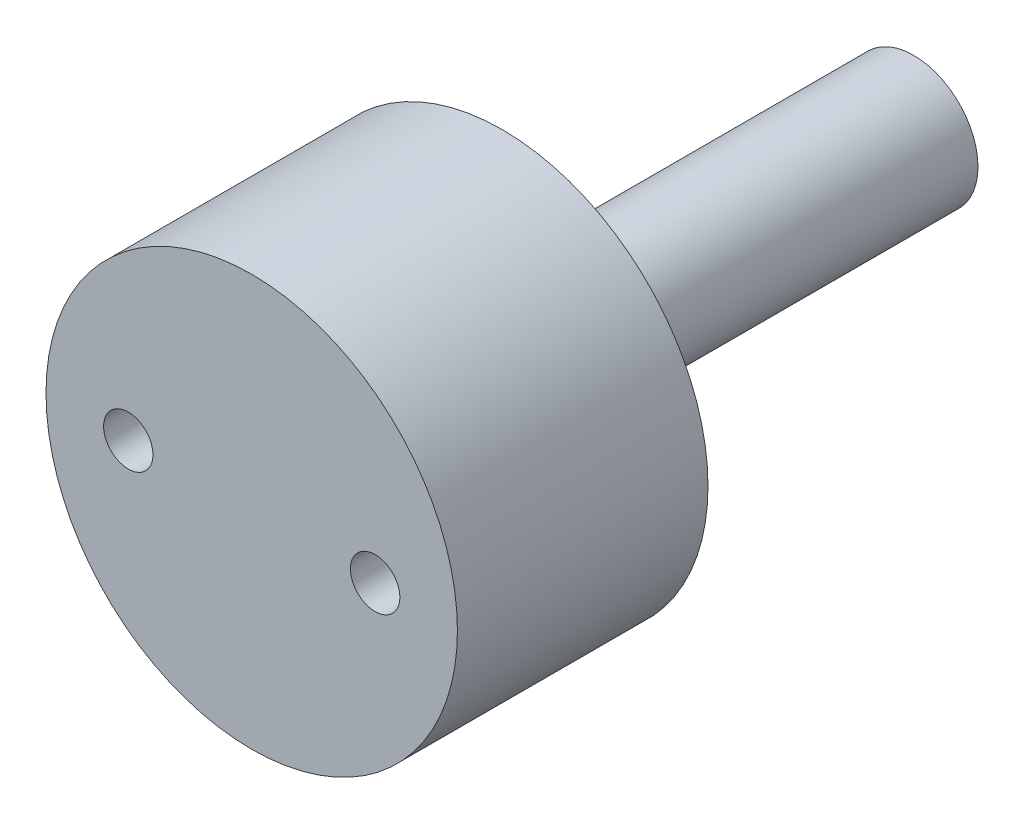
ISO-10303-21;
HEADER;
FILE_DESCRIPTION(('STEP AP214'),'2;1');
FILE_NAME('part.step','',(''),(''),'','','');
FILE_SCHEMA(('AUTOMOTIVE_DESIGN { 1 0 10303 214 1 1 1 1 }'));
ENDSEC;
DATA;
#1=APPLICATION_CONTEXT('core data for automotive mechanical design processes');
#2=APPLICATION_PROTOCOL_DEFINITION('international standard','automotive_design',2000,#1);
#3=PRODUCT_CONTEXT('',#1,'mechanical');
#4=PRODUCT('Part','Part','',(#3));
#5=PRODUCT_RELATED_PRODUCT_CATEGORY('part','',(#4));
#6=PRODUCT_DEFINITION_FORMATION('','',#4);
#7=PRODUCT_DEFINITION_CONTEXT('part definition',#1,'design');
#8=PRODUCT_DEFINITION('design','',#6,#7);
#9=PRODUCT_DEFINITION_SHAPE('','',#8);
#10=(LENGTH_UNIT() NAMED_UNIT(*) SI_UNIT(.MILLI.,.METRE.));
#11=(NAMED_UNIT(*) PLANE_ANGLE_UNIT() SI_UNIT($,.RADIAN.));
#12=(NAMED_UNIT(*) SI_UNIT($,.STERADIAN.) SOLID_ANGLE_UNIT());
#13=UNCERTAINTY_MEASURE_WITH_UNIT(LENGTH_MEASURE(1.E-05),#10,'distance_accuracy_value','');
#14=(GEOMETRIC_REPRESENTATION_CONTEXT(3) GLOBAL_UNCERTAINTY_ASSIGNED_CONTEXT((#13)) GLOBAL_UNIT_ASSIGNED_CONTEXT((#10,
#11,#12)) REPRESENTATION_CONTEXT('',''));
#15=CARTESIAN_POINT('',(0.,0.,0.));
#16=DIRECTION('',(0.,0.,1.));
#17=DIRECTION('',(1.,0.,0.));
#18=AXIS2_PLACEMENT_3D('',#15,#16,#17);
#19=CARTESIAN_POINT('',(-7.48145454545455,0.,17.8943));
#20=DIRECTION('',(0.,0.,1.));
#21=DIRECTION('',(1.,0.,0.));
#22=AXIS2_PLACEMENT_3D('',#19,#20,#21);
#23=PLANE('',#22);
#24=CARTESIAN_POINT('',(-7.61999999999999,0.,17.8943));
#25=DIRECTION('',(0.,0.,-1.));
#26=DIRECTION('',(-1.,0.,0.));
#27=AXIS2_PLACEMENT_3D('',#24,#25,#26);
#28=CIRCLE('',#27,1.524);
#29=CARTESIAN_POINT('',(-9.14399999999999,0.,17.8943));
#30=VERTEX_POINT('',#29);
#31=EDGE_CURVE('E19',#30,#30,#28,.F.);
#32=ORIENTED_EDGE('',*,*,#31,.T.);
#33=EDGE_LOOP('',(#32));
#34=FACE_BOUND('',#33,.T.);
#35=ADVANCED_FACE('F15',(#34),#23,.T.);
#36=CARTESIAN_POINT('',(7.75854545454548,0.,17.8943));
#37=DIRECTION('',(0.,0.,1.));
#38=DIRECTION('',(1.,0.,0.));
#39=AXIS2_PLACEMENT_3D('',#36,#37,#38);
#40=PLANE('',#39);
#41=CARTESIAN_POINT('',(7.62,0.,17.8943));
#42=DIRECTION('',(0.,0.,-1.));
#43=DIRECTION('',(-1.,0.,0.));
#44=AXIS2_PLACEMENT_3D('',#41,#42,#43);
#45=CIRCLE('',#44,1.524);
#46=CARTESIAN_POINT('',(6.096,0.,17.8943));
#47=VERTEX_POINT('',#46);
#48=EDGE_CURVE('E41',#47,#47,#45,.F.);
#49=ORIENTED_EDGE('',*,*,#48,.T.);
#50=EDGE_LOOP('',(#49));
#51=FACE_BOUND('',#50,.T.);
#52=ADVANCED_FACE('F63',(#51),#40,.T.);
#53=CARTESIAN_POINT('',(0.360795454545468,0.,-20.4343));
#54=DIRECTION('',(0.,0.,1.));
#55=DIRECTION('',(1.,0.,0.));
#56=AXIS2_PLACEMENT_3D('',#53,#54,#55);
#57=PLANE('',#56);
#58=CARTESIAN_POINT('',(0.,0.,-20.4343));
#59=DIRECTION('',(0.,0.,1.));
#60=DIRECTION('',(1.,0.,0.));
#61=AXIS2_PLACEMENT_3D('',#58,#59,#60);
#62=CIRCLE('',#61,3.96875);
#63=CARTESIAN_POINT('',(3.96875,0.,-20.4343));
#64=VERTEX_POINT('',#63);
#65=EDGE_CURVE('E39',#64,#64,#62,.T.);
#66=ORIENTED_EDGE('',*,*,#65,.F.);
#67=EDGE_LOOP('',(#66));
#68=FACE_BOUND('',#67,.T.);
#69=ADVANCED_FACE('F52',(#68),#57,.F.);
#70=CARTESIAN_POINT('',(-7.61999999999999,0.,20.4343));
#71=DIRECTION('',(0.,0.,-1.));
#72=DIRECTION('',(-1.,0.,0.));
#73=AXIS2_PLACEMENT_3D('',#70,#71,#72);
#74=CYLINDRICAL_SURFACE('',#73,1.524);
#75=CARTESIAN_POINT('',(-7.61999999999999,0.,20.4343));
#76=DIRECTION('',(0.,0.,-1.));
#77=DIRECTION('',(-1.,0.,0.));
#78=AXIS2_PLACEMENT_3D('',#75,#76,#77);
#79=CIRCLE('',#78,1.524);
#80=CARTESIAN_POINT('',(-9.14399999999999,0.,20.4343));
#81=VERTEX_POINT('',#80);
#82=EDGE_CURVE('E36',#81,#81,#79,.T.);
#83=ORIENTED_EDGE('',*,*,#82,.F.);
#84=EDGE_LOOP('',(#83));
#85=FACE_BOUND('',#84,.T.);
#86=ORIENTED_EDGE('',*,*,#31,.F.);
#87=EDGE_LOOP('',(#86));
#88=FACE_BOUND('',#87,.T.);
#89=ADVANCED_FACE('F49',(#85,#88),#74,.F.);
#90=CARTESIAN_POINT('',(7.62,0.,20.4343));
#91=DIRECTION('',(0.,0.,-1.));
#92=DIRECTION('',(-1.,0.,0.));
#93=AXIS2_PLACEMENT_3D('',#90,#91,#92);
#94=CYLINDRICAL_SURFACE('',#93,1.524);
#95=CARTESIAN_POINT('',(7.62,0.,20.4343));
#96=DIRECTION('',(0.,0.,-1.));
#97=DIRECTION('',(-1.,0.,0.));
#98=AXIS2_PLACEMENT_3D('',#95,#96,#97);
#99=CIRCLE('',#98,1.524);
#100=CARTESIAN_POINT('',(6.096,0.,20.4343));
#101=VERTEX_POINT('',#100);
#102=EDGE_CURVE('E33',#101,#101,#99,.T.);
#103=ORIENTED_EDGE('',*,*,#102,.F.);
#104=EDGE_LOOP('',(#103));
#105=FACE_BOUND('',#104,.T.);
#106=ORIENTED_EDGE('',*,*,#48,.F.);
#107=EDGE_LOOP('',(#106));
#108=FACE_BOUND('',#107,.T.);
#109=ADVANCED_FACE('F51',(#105,#108),#94,.F.);
#110=CARTESIAN_POINT('',(0.,0.,-20.4343));
#111=DIRECTION('',(0.,0.,1.));
#112=DIRECTION('',(1.,0.,0.));
#113=AXIS2_PLACEMENT_3D('',#110,#111,#112);
#114=CYLINDRICAL_SURFACE('',#113,3.96875);
#115=ORIENTED_EDGE('',*,*,#65,.T.);
#116=EDGE_LOOP('',(#115));
#117=FACE_BOUND('',#116,.T.);
#118=CARTESIAN_POINT('',(0.,0.,4.96569999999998));
#119=DIRECTION('',(0.,0.,1.));
#120=DIRECTION('',(1.,0.,0.));
#121=AXIS2_PLACEMENT_3D('',#118,#119,#120);
#122=CIRCLE('',#121,3.96875);
#123=CARTESIAN_POINT('',(3.96875,0.,4.96569999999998));
#124=VERTEX_POINT('',#123);
#125=EDGE_CURVE('E28',#124,#124,#122,.F.);
#126=ORIENTED_EDGE('',*,*,#125,.T.);
#127=EDGE_LOOP('',(#126));
#128=FACE_BOUND('',#127,.T.);
#129=ADVANCED_FACE('F60',(#117,#128),#114,.T.);
#130=CARTESIAN_POINT('',(1.15454545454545,0.,20.4343));
#131=DIRECTION('',(0.,0.,1.));
#132=DIRECTION('',(1.,0.,0.));
#133=AXIS2_PLACEMENT_3D('',#130,#131,#132);
#134=PLANE('',#133);
#135=ORIENTED_EDGE('',*,*,#102,.T.);
#136=EDGE_LOOP('',(#135));
#137=FACE_BOUND('',#136,.T.);
#138=ORIENTED_EDGE('',*,*,#82,.T.);
#139=EDGE_LOOP('',(#138));
#140=FACE_BOUND('',#139,.T.);
#141=CARTESIAN_POINT('',(0.,0.,20.4343));
#142=DIRECTION('',(0.,0.,-1.));
#143=DIRECTION('',(-1.,0.,0.));
#144=AXIS2_PLACEMENT_3D('',#141,#142,#143);
#145=CIRCLE('',#144,12.7);
#146=CARTESIAN_POINT('',(-12.7,0.,20.4343));
#147=VERTEX_POINT('',#146);
#148=EDGE_CURVE('E23',#147,#147,#145,.T.);
#149=ORIENTED_EDGE('',*,*,#148,.F.);
#150=EDGE_LOOP('',(#149));
#151=FACE_BOUND('',#150,.T.);
#152=ADVANCED_FACE('F73',(#137,#140,#151),#134,.T.);
#153=CARTESIAN_POINT('',(1.15454545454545,0.,4.96569999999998));
#154=DIRECTION('',(0.,0.,1.));
#155=DIRECTION('',(1.,0.,0.));
#156=AXIS2_PLACEMENT_3D('',#153,#154,#155);
#157=PLANE('',#156);
#158=ORIENTED_EDGE('',*,*,#125,.F.);
#159=EDGE_LOOP('',(#158));
#160=FACE_BOUND('',#159,.T.);
#161=CARTESIAN_POINT('',(0.,0.,4.9657));
#162=DIRECTION('',(0.,0.,-1.));
#163=DIRECTION('',(-1.,0.,0.));
#164=AXIS2_PLACEMENT_3D('',#161,#162,#163);
#165=CIRCLE('',#164,12.7);
#166=CARTESIAN_POINT('',(-12.7,0.,4.9657));
#167=VERTEX_POINT('',#166);
#168=EDGE_CURVE('E10',#167,#167,#165,.F.);
#169=ORIENTED_EDGE('',*,*,#168,.F.);
#170=EDGE_LOOP('',(#169));
#171=FACE_BOUND('',#170,.T.);
#172=ADVANCED_FACE('F68',(#160,#171),#157,.F.);
#173=CARTESIAN_POINT('',(0.,0.,20.4343));
#174=DIRECTION('',(0.,0.,-1.));
#175=DIRECTION('',(-1.,0.,0.));
#176=AXIS2_PLACEMENT_3D('',#173,#174,#175);
#177=CYLINDRICAL_SURFACE('',#176,12.7);
#178=ORIENTED_EDGE('',*,*,#148,.T.);
#179=EDGE_LOOP('',(#178));
#180=FACE_BOUND('',#179,.T.);
#181=ORIENTED_EDGE('',*,*,#168,.T.);
#182=EDGE_LOOP('',(#181));
#183=FACE_BOUND('',#182,.T.);
#184=ADVANCED_FACE('F17',(#180,#183),#177,.T.);
#185=CLOSED_SHELL('',(#35,#52,#69,#89,#109,#129,#152,#172,#184));
#186=MANIFOLD_SOLID_BREP('B1',#185);
#187=ADVANCED_BREP_SHAPE_REPRESENTATION('',(#18,#186),#14);
#188=SHAPE_DEFINITION_REPRESENTATION(#9,#187);
ENDSEC;
END-ISO-10303-21;
